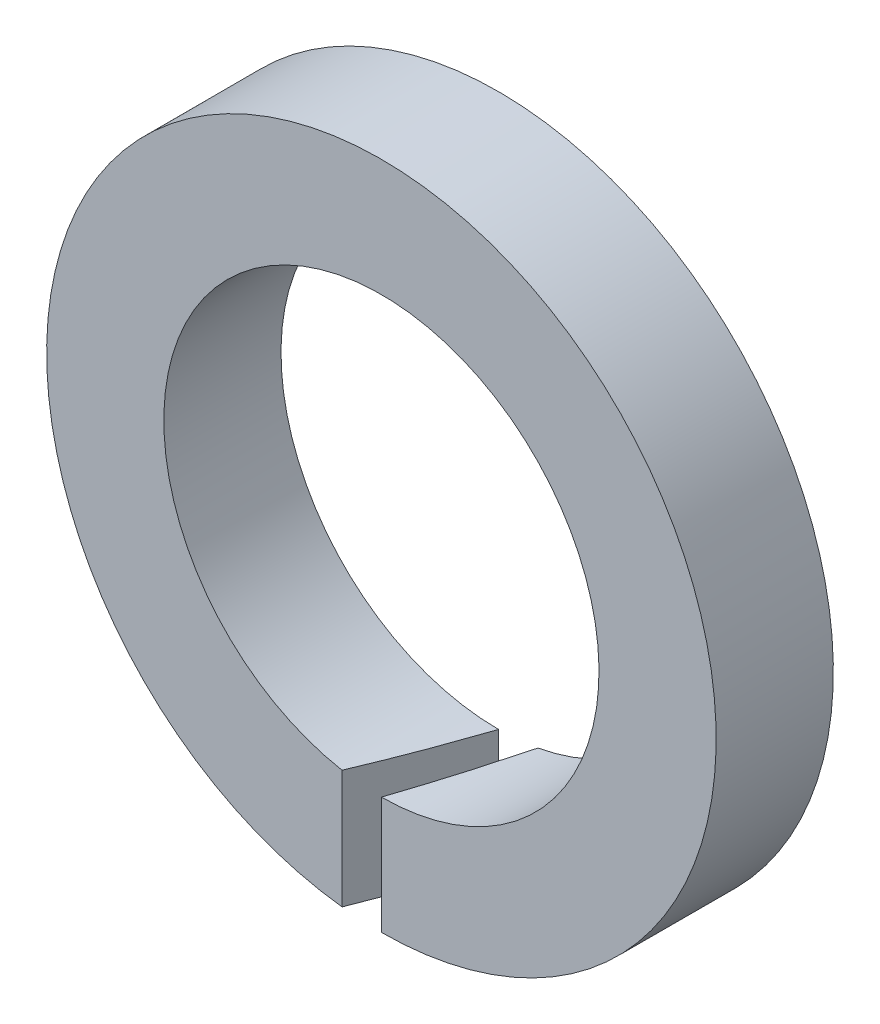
ISO-10303-21;
HEADER;
FILE_DESCRIPTION(('STEP AP214'),'2;1');
FILE_NAME('part.step','',(''),(''),'','','');
FILE_SCHEMA(('AUTOMOTIVE_DESIGN { 1 0 10303 214 1 1 1 1 }'));
ENDSEC;
DATA;
#1=APPLICATION_CONTEXT('core data for automotive mechanical design processes');
#2=APPLICATION_PROTOCOL_DEFINITION('international standard','automotive_design',2000,#1);
#3=PRODUCT_CONTEXT('',#1,'mechanical');
#4=PRODUCT('Part','Part','',(#3));
#5=PRODUCT_RELATED_PRODUCT_CATEGORY('part','',(#4));
#6=PRODUCT_DEFINITION_FORMATION('','',#4);
#7=PRODUCT_DEFINITION_CONTEXT('part definition',#1,'design');
#8=PRODUCT_DEFINITION('design','',#6,#7);
#9=PRODUCT_DEFINITION_SHAPE('','',#8);
#10=(LENGTH_UNIT() NAMED_UNIT(*) SI_UNIT(.MILLI.,.METRE.));
#11=(NAMED_UNIT(*) PLANE_ANGLE_UNIT() SI_UNIT($,.RADIAN.));
#12=(NAMED_UNIT(*) SI_UNIT($,.STERADIAN.) SOLID_ANGLE_UNIT());
#13=UNCERTAINTY_MEASURE_WITH_UNIT(LENGTH_MEASURE(1.E-05),#10,'distance_accuracy_value','');
#14=(GEOMETRIC_REPRESENTATION_CONTEXT(3) GLOBAL_UNCERTAINTY_ASSIGNED_CONTEXT((#13)) GLOBAL_UNIT_ASSIGNED_CONTEXT((#10,
#11,#12)) REPRESENTATION_CONTEXT('',''));
#15=CARTESIAN_POINT('',(0.,0.,0.));
#16=DIRECTION('',(0.,0.,1.));
#17=DIRECTION('',(1.,0.,0.));
#18=AXIS2_PLACEMENT_3D('',#15,#16,#17);
#19=CARTESIAN_POINT('',(0.,0.,0.));
#20=DIRECTION('',(0.,0.,-1.));
#21=DIRECTION('',(0.,1.,0.));
#22=AXIS2_PLACEMENT_3D('',#19,#20,#21);
#23=CYLINDRICAL_SURFACE('',#22,6.5);
#24=CARTESIAN_POINT('',(0.,0.,3.5));
#25=DIRECTION('',(0.,0.,-1.));
#26=DIRECTION('',(0.,1.,0.));
#27=AXIS2_PLACEMENT_3D('',#24,#25,#26);
#28=CIRCLE('',#27,6.5);
#29=CARTESIAN_POINT('',(-1.17647058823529,-6.39264553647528,3.5));
#30=VERTEX_POINT('',#29);
#31=CARTESIAN_POINT('',(0.,-6.5,3.5));
#32=VERTEX_POINT('',#31);
#33=EDGE_CURVE('E11',#30,#32,#28,.T.);
#34=ORIENTED_EDGE('',*,*,#33,.F.);
#35=CARTESIAN_POINT('',(0.,0.,0.));
#36=DIRECTION('',(-0.947883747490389,0.,-0.318616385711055));
#37=DIRECTION('',(0.318616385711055,0.,-0.947883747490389));
#38=AXIS2_PLACEMENT_3D('',#35,#36,#37);
#39=ELLIPSE('',#38,20.4007084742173,6.5);
#40=CARTESIAN_POINT('',(0.,-6.5,0.));
#41=VERTEX_POINT('',#40);
#42=EDGE_CURVE('E78',#30,#41,#39,.F.);
#43=ORIENTED_EDGE('',*,*,#42,.T.);
#44=CARTESIAN_POINT('',(0.,0.,0.));
#45=DIRECTION('',(0.,0.,-1.));
#46=DIRECTION('',(0.,1.,0.));
#47=AXIS2_PLACEMENT_3D('',#44,#45,#46);
#48=CIRCLE('',#47,6.5);
#49=CARTESIAN_POINT('',(1.17647058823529,-6.39264553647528,0.));
#50=VERTEX_POINT('',#49);
#51=EDGE_CURVE('E73',#41,#50,#48,.T.);
#52=ORIENTED_EDGE('',*,*,#51,.T.);
#53=CARTESIAN_POINT('',(0.,0.,3.5));
#54=DIRECTION('',(-0.947883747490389,0.,-0.318616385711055));
#55=DIRECTION('',(0.318616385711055,0.,-0.947883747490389));
#56=AXIS2_PLACEMENT_3D('',#53,#54,#55);
#57=ELLIPSE('',#56,20.4007084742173,6.5);
#58=EDGE_CURVE('E30',#32,#50,#57,.F.);
#59=ORIENTED_EDGE('',*,*,#58,.F.);
#60=EDGE_LOOP('',(#34,#43,#52,#59));
#61=FACE_BOUND('',#60,.T.);
#62=ADVANCED_FACE('F16',(#61),#23,.F.);
#63=CARTESIAN_POINT('',(10.,0.,3.5));
#64=DIRECTION('',(0.,0.,1.));
#65=DIRECTION('',(0.,-1.,0.));
#66=AXIS2_PLACEMENT_3D('',#63,#64,#65);
#67=PLANE('',#66);
#68=DIRECTION('',(0.,1.,0.));
#69=VECTOR('',#68,1.);
#70=CARTESIAN_POINT('',(-1.17647058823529,-10.35,3.5));
#71=LINE('',#70,#69);
#72=CARTESIAN_POINT('',(-1.17647058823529,-9.93055471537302,3.5));
#73=VERTEX_POINT('',#72);
#74=EDGE_CURVE('E63',#73,#30,#71,.T.);
#75=ORIENTED_EDGE('',*,*,#74,.T.);
#76=ORIENTED_EDGE('',*,*,#33,.T.);
#77=DIRECTION('',(0.,1.,0.));
#78=VECTOR('',#77,1.);
#79=CARTESIAN_POINT('',(0.,-10.35,3.5));
#80=LINE('',#79,#78);
#81=CARTESIAN_POINT('',(0.,-10.,3.5));
#82=VERTEX_POINT('',#81);
#83=EDGE_CURVE('E57',#82,#32,#80,.T.);
#84=ORIENTED_EDGE('',*,*,#83,.F.);
#85=CARTESIAN_POINT('',(0.,0.,3.5));
#86=DIRECTION('',(0.,0.,-1.));
#87=DIRECTION('',(0.,1.,0.));
#88=AXIS2_PLACEMENT_3D('',#85,#86,#87);
#89=CIRCLE('',#88,10.);
#90=EDGE_CURVE('E23',#73,#82,#89,.T.);
#91=ORIENTED_EDGE('',*,*,#90,.F.);
#92=EDGE_LOOP('',(#75,#76,#84,#91));
#93=FACE_BOUND('',#92,.T.);
#94=ADVANCED_FACE('F68',(#93),#67,.T.);
#95=CARTESIAN_POINT('',(0.,0.,0.));
#96=DIRECTION('',(0.,0.,-1.));
#97=DIRECTION('',(0.,1.,0.));
#98=AXIS2_PLACEMENT_3D('',#95,#96,#97);
#99=CYLINDRICAL_SURFACE('',#98,10.);
#100=CARTESIAN_POINT('',(0.,0.,0.));
#101=DIRECTION('',(-0.947883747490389,0.,-0.318616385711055));
#102=DIRECTION('',(0.318616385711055,0.,-0.947883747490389));
#103=AXIS2_PLACEMENT_3D('',#100,#101,#102);
#104=ELLIPSE('',#103,31.3857053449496,10.);
#105=CARTESIAN_POINT('',(0.,-10.,0.));
#106=VERTEX_POINT('',#105);
#107=EDGE_CURVE('E38',#73,#106,#104,.F.);
#108=ORIENTED_EDGE('',*,*,#107,.F.);
#109=ORIENTED_EDGE('',*,*,#90,.T.);
#110=CARTESIAN_POINT('',(0.,0.,3.5));
#111=DIRECTION('',(-0.947883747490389,0.,-0.318616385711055));
#112=DIRECTION('',(0.318616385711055,0.,-0.947883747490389));
#113=AXIS2_PLACEMENT_3D('',#110,#111,#112);
#114=ELLIPSE('',#113,31.3857053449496,10.);
#115=CARTESIAN_POINT('',(1.17647058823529,-9.93055471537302,0.));
#116=VERTEX_POINT('',#115);
#117=EDGE_CURVE('E54',#82,#116,#114,.F.);
#118=ORIENTED_EDGE('',*,*,#117,.T.);
#119=CARTESIAN_POINT('',(0.,0.,0.));
#120=DIRECTION('',(0.,0.,-1.));
#121=DIRECTION('',(0.,1.,0.));
#122=AXIS2_PLACEMENT_3D('',#119,#120,#121);
#123=CIRCLE('',#122,10.);
#124=EDGE_CURVE('E72',#106,#116,#123,.T.);
#125=ORIENTED_EDGE('',*,*,#124,.F.);
#126=EDGE_LOOP('',(#108,#109,#118,#125));
#127=FACE_BOUND('',#126,.T.);
#128=ADVANCED_FACE('F71',(#127),#99,.T.);
#129=CARTESIAN_POINT('',(6.5,0.,0.));
#130=DIRECTION('',(0.,0.,-1.));
#131=DIRECTION('',(0.,1.,0.));
#132=AXIS2_PLACEMENT_3D('',#129,#130,#131);
#133=PLANE('',#132);
#134=DIRECTION('',(0.,1.,0.));
#135=VECTOR('',#134,1.);
#136=CARTESIAN_POINT('',(0.,-10.35,0.));
#137=LINE('',#136,#135);
#138=EDGE_CURVE('E83',#106,#41,#137,.T.);
#139=ORIENTED_EDGE('',*,*,#138,.F.);
#140=ORIENTED_EDGE('',*,*,#124,.T.);
#141=DIRECTION('',(0.,1.,0.));
#142=VECTOR('',#141,1.);
#143=CARTESIAN_POINT('',(1.17647058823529,-10.35,0.));
#144=LINE('',#143,#142);
#145=EDGE_CURVE('E58',#116,#50,#144,.T.);
#146=ORIENTED_EDGE('',*,*,#145,.T.);
#147=ORIENTED_EDGE('',*,*,#51,.F.);
#148=EDGE_LOOP('',(#139,#140,#146,#147));
#149=FACE_BOUND('',#148,.T.);
#150=ADVANCED_FACE('F89',(#149),#133,.T.);
#151=CARTESIAN_POINT('',(1.17647058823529,-10.35,0.));
#152=DIRECTION('',(-0.947883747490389,0.,-0.318616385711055));
#153=DIRECTION('',(0.318616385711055,0.,-0.947883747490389));
#154=AXIS2_PLACEMENT_3D('',#151,#152,#153);
#155=PLANE('',#154);
#156=ORIENTED_EDGE('',*,*,#58,.T.);
#157=ORIENTED_EDGE('',*,*,#145,.F.);
#158=ORIENTED_EDGE('',*,*,#117,.F.);
#159=ORIENTED_EDGE('',*,*,#83,.T.);
#160=EDGE_LOOP('',(#156,#157,#158,#159));
#161=FACE_BOUND('',#160,.T.);
#162=ADVANCED_FACE('F56',(#161),#155,.T.);
#163=CARTESIAN_POINT('',(0.,-10.35,0.));
#164=DIRECTION('',(-0.947883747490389,0.,-0.318616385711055));
#165=DIRECTION('',(0.318616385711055,0.,-0.947883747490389));
#166=AXIS2_PLACEMENT_3D('',#163,#164,#165);
#167=PLANE('',#166);
#168=ORIENTED_EDGE('',*,*,#74,.F.);
#169=ORIENTED_EDGE('',*,*,#107,.T.);
#170=ORIENTED_EDGE('',*,*,#138,.T.);
#171=ORIENTED_EDGE('',*,*,#42,.F.);
#172=EDGE_LOOP('',(#168,#169,#170,#171));
#173=FACE_BOUND('',#172,.T.);
#174=ADVANCED_FACE('F90',(#173),#167,.F.);
#175=CLOSED_SHELL('',(#62,#94,#128,#150,#162,#174));
#176=MANIFOLD_SOLID_BREP('B1',#175);
#177=ADVANCED_BREP_SHAPE_REPRESENTATION('',(#18,#176),#14);
#178=SHAPE_DEFINITION_REPRESENTATION(#9,#177);
ENDSEC;
END-ISO-10303-21;
